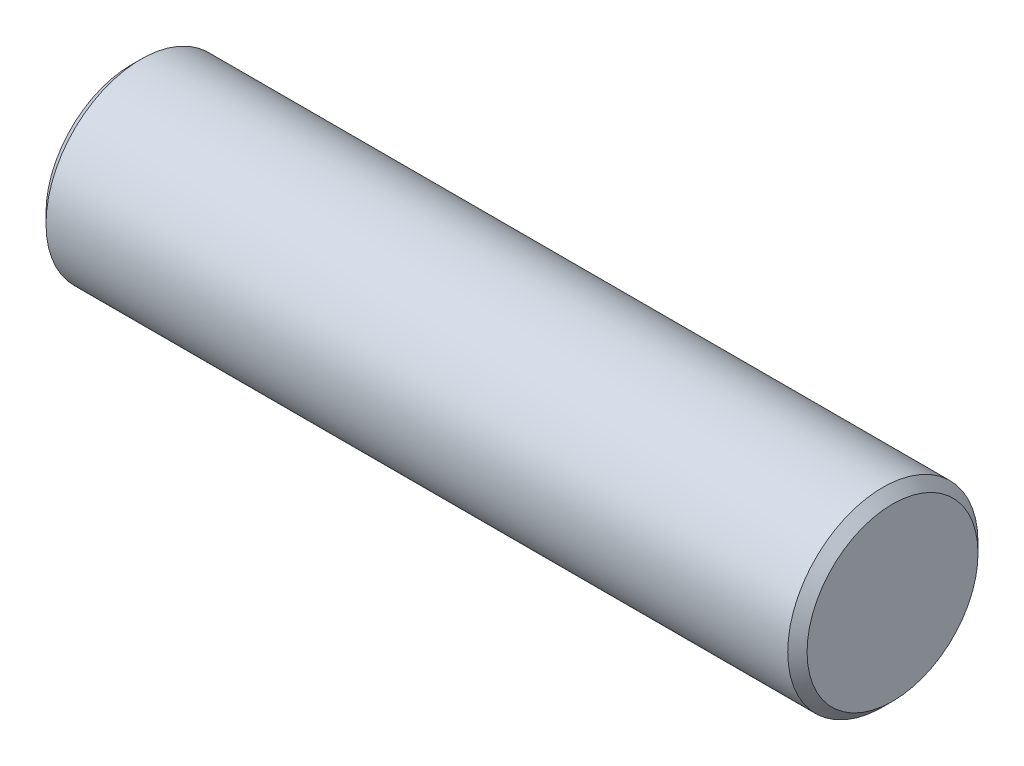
ISO-10303-21;
HEADER;
FILE_DESCRIPTION(('STEP AP214'),'2;1');
FILE_NAME('part.step','',(''),(''),'','','');
FILE_SCHEMA(('AUTOMOTIVE_DESIGN { 1 0 10303 214 1 1 1 1 }'));
ENDSEC;
DATA;
#1=APPLICATION_CONTEXT('core data for automotive mechanical design processes');
#2=APPLICATION_PROTOCOL_DEFINITION('international standard','automotive_design',2000,#1);
#3=PRODUCT_CONTEXT('',#1,'mechanical');
#4=PRODUCT('Part','Part','',(#3));
#5=PRODUCT_RELATED_PRODUCT_CATEGORY('part','',(#4));
#6=PRODUCT_DEFINITION_FORMATION('','',#4);
#7=PRODUCT_DEFINITION_CONTEXT('part definition',#1,'design');
#8=PRODUCT_DEFINITION('design','',#6,#7);
#9=PRODUCT_DEFINITION_SHAPE('','',#8);
#10=(LENGTH_UNIT() NAMED_UNIT(*) SI_UNIT(.MILLI.,.METRE.));
#11=(NAMED_UNIT(*) PLANE_ANGLE_UNIT() SI_UNIT($,.RADIAN.));
#12=(NAMED_UNIT(*) SI_UNIT($,.STERADIAN.) SOLID_ANGLE_UNIT());
#13=UNCERTAINTY_MEASURE_WITH_UNIT(LENGTH_MEASURE(1.E-05),#10,'distance_accuracy_value','');
#14=(GEOMETRIC_REPRESENTATION_CONTEXT(3) GLOBAL_UNCERTAINTY_ASSIGNED_CONTEXT((#13)) GLOBAL_UNIT_ASSIGNED_CONTEXT((#10,
#11,#12)) REPRESENTATION_CONTEXT('',''));
#15=CARTESIAN_POINT('',(0.,0.,0.));
#16=DIRECTION('',(0.,0.,1.));
#17=DIRECTION('',(1.,0.,0.));
#18=AXIS2_PLACEMENT_3D('',#15,#16,#17);
#19=CARTESIAN_POINT('',(10.,0.,0.));
#20=DIRECTION('',(-1.,0.,0.));
#21=DIRECTION('',(0.,0.,1.));
#22=AXIS2_PLACEMENT_3D('',#19,#20,#21);
#23=CYLINDRICAL_SURFACE('',#22,2.5);
#24=CARTESIAN_POINT('',(9.746,0.,0.));
#25=DIRECTION('',(1.,0.,0.));
#26=DIRECTION('',(0.,0.,-1.));
#27=AXIS2_PLACEMENT_3D('',#24,#25,#26);
#28=CIRCLE('',#27,2.5);
#29=CARTESIAN_POINT('',(9.746,0.,-2.5));
#30=VERTEX_POINT('',#29);
#31=EDGE_CURVE('E36',#30,#30,#28,.F.);
#32=ORIENTED_EDGE('',*,*,#31,.T.);
#33=EDGE_LOOP('',(#32));
#34=FACE_BOUND('',#33,.T.);
#35=CARTESIAN_POINT('',(-9.746,0.,0.));
#36=DIRECTION('',(1.,0.,0.));
#37=DIRECTION('',(0.,0.,-1.));
#38=AXIS2_PLACEMENT_3D('',#35,#36,#37);
#39=CIRCLE('',#38,2.5);
#40=CARTESIAN_POINT('',(-9.746,0.,-2.5));
#41=VERTEX_POINT('',#40);
#42=EDGE_CURVE('E40',#41,#41,#39,.T.);
#43=ORIENTED_EDGE('',*,*,#42,.T.);
#44=EDGE_LOOP('',(#43));
#45=FACE_BOUND('',#44,.T.);
#46=ADVANCED_FACE('F30',(#34,#45),#23,.T.);
#47=CARTESIAN_POINT('',(10.,0.,0.));
#48=DIRECTION('',(1.,0.,0.));
#49=DIRECTION('',(0.,0.,-1.));
#50=AXIS2_PLACEMENT_3D('',#47,#48,#49);
#51=PLANE('',#50);
#52=CARTESIAN_POINT('',(10.,0.,0.));
#53=DIRECTION('',(1.,0.,0.));
#54=DIRECTION('',(0.,0.,-1.));
#55=AXIS2_PLACEMENT_3D('',#52,#53,#54);
#56=CIRCLE('',#55,2.246);
#57=CARTESIAN_POINT('',(10.,0.,-2.246));
#58=VERTEX_POINT('',#57);
#59=EDGE_CURVE('E44',#58,#58,#56,.T.);
#60=ORIENTED_EDGE('',*,*,#59,.T.);
#61=EDGE_LOOP('',(#60));
#62=FACE_BOUND('',#61,.T.);
#63=ADVANCED_FACE('F50',(#62),#51,.T.);
#64=CARTESIAN_POINT('',(-10.,0.,0.));
#65=DIRECTION('',(1.,0.,0.));
#66=DIRECTION('',(0.,0.,-1.));
#67=AXIS2_PLACEMENT_3D('',#64,#65,#66);
#68=PLANE('',#67);
#69=CARTESIAN_POINT('',(-10.,0.,0.));
#70=DIRECTION('',(1.,0.,0.));
#71=DIRECTION('',(0.,0.,-1.));
#72=AXIS2_PLACEMENT_3D('',#69,#70,#71);
#73=CIRCLE('',#72,2.246);
#74=CARTESIAN_POINT('',(-10.,0.,-2.246));
#75=VERTEX_POINT('',#74);
#76=EDGE_CURVE('E10',#75,#75,#73,.F.);
#77=ORIENTED_EDGE('',*,*,#76,.T.);
#78=EDGE_LOOP('',(#77));
#79=FACE_BOUND('',#78,.T.);
#80=ADVANCED_FACE('F55',(#79),#68,.F.);
#81=CARTESIAN_POINT('',(10.,0.,0.));
#82=DIRECTION('',(-1.,0.,0.));
#83=DIRECTION('',(0.,0.,1.));
#84=AXIS2_PLACEMENT_3D('',#81,#82,#83);
#85=CONICAL_SURFACE('',#84,2.246,0.785398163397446);
#86=ORIENTED_EDGE('',*,*,#31,.F.);
#87=EDGE_LOOP('',(#86));
#88=FACE_BOUND('',#87,.T.);
#89=ORIENTED_EDGE('',*,*,#59,.F.);
#90=EDGE_LOOP('',(#89));
#91=FACE_BOUND('',#90,.T.);
#92=ADVANCED_FACE('F52',(#88,#91),#85,.T.);
#93=CARTESIAN_POINT('',(-9.746,0.,0.));
#94=DIRECTION('',(1.,0.,0.));
#95=DIRECTION('',(0.,0.,-1.));
#96=AXIS2_PLACEMENT_3D('',#93,#94,#95);
#97=CONICAL_SURFACE('',#96,2.5,0.785398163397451);
#98=ORIENTED_EDGE('',*,*,#76,.F.);
#99=EDGE_LOOP('',(#98));
#100=FACE_BOUND('',#99,.T.);
#101=ORIENTED_EDGE('',*,*,#42,.F.);
#102=EDGE_LOOP('',(#101));
#103=FACE_BOUND('',#102,.T.);
#104=ADVANCED_FACE('F54',(#100,#103),#97,.T.);
#105=CLOSED_SHELL('',(#46,#63,#80,#92,#104));
#106=MANIFOLD_SOLID_BREP('B2',#105);
#107=ADVANCED_BREP_SHAPE_REPRESENTATION('',(#18,#106),#14);
#108=SHAPE_DEFINITION_REPRESENTATION(#9,#107);
ENDSEC;
END-ISO-10303-21;
